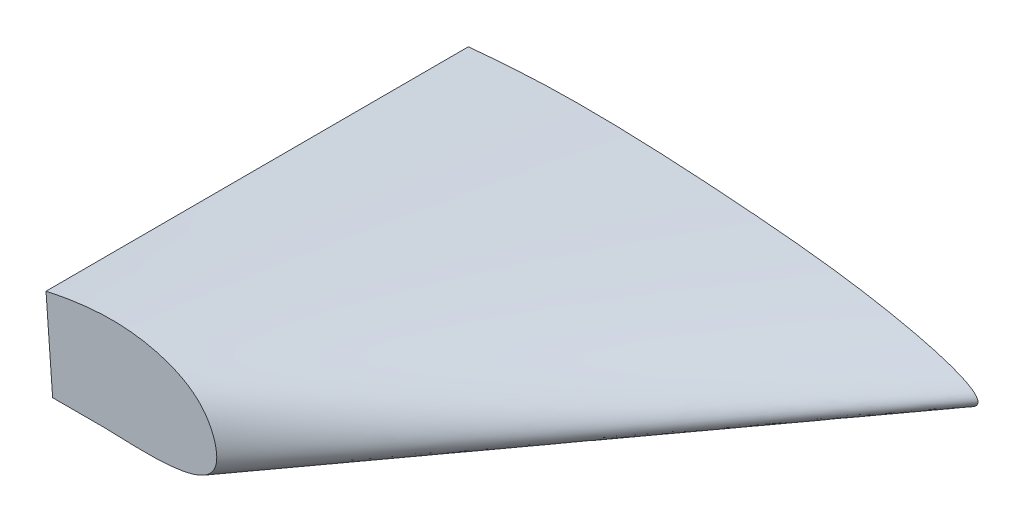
ISO-10303-21;
HEADER;
FILE_DESCRIPTION(('STEP AP214'),'2;1');
FILE_NAME('part.step','',(''),(''),'','','');
FILE_SCHEMA(('AUTOMOTIVE_DESIGN { 1 0 10303 214 1 1 1 1 }'));
ENDSEC;
DATA;
#1=APPLICATION_CONTEXT('core data for automotive mechanical design processes');
#2=APPLICATION_PROTOCOL_DEFINITION('international standard','automotive_design',2000,#1);
#3=PRODUCT_CONTEXT('',#1,'mechanical');
#4=PRODUCT('Part','Part','',(#3));
#5=PRODUCT_RELATED_PRODUCT_CATEGORY('part','',(#4));
#6=PRODUCT_DEFINITION_FORMATION('','',#4);
#7=PRODUCT_DEFINITION_CONTEXT('part definition',#1,'design');
#8=PRODUCT_DEFINITION('design','',#6,#7);
#9=PRODUCT_DEFINITION_SHAPE('','',#8);
#10=(LENGTH_UNIT() NAMED_UNIT(*) SI_UNIT(.MILLI.,.METRE.));
#11=(NAMED_UNIT(*) PLANE_ANGLE_UNIT() SI_UNIT($,.RADIAN.));
#12=(NAMED_UNIT(*) SI_UNIT($,.STERADIAN.) SOLID_ANGLE_UNIT());
#13=UNCERTAINTY_MEASURE_WITH_UNIT(LENGTH_MEASURE(1.E-05),#10,'distance_accuracy_value','');
#14=(GEOMETRIC_REPRESENTATION_CONTEXT(3) GLOBAL_UNCERTAINTY_ASSIGNED_CONTEXT((#13)) GLOBAL_UNIT_ASSIGNED_CONTEXT((#10,
#11,#12)) REPRESENTATION_CONTEXT('',''));
#15=CARTESIAN_POINT('',(0.,0.,0.));
#16=DIRECTION('',(0.,0.,1.));
#17=DIRECTION('',(1.,0.,0.));
#18=AXIS2_PLACEMENT_3D('',#15,#16,#17);
#19=CARTESIAN_POINT('',(2358.12019505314,78.0006455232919,1168.4));
#20=DIRECTION('',(0.,0.,1.));
#21=DIRECTION('',(-1.,0.,0.));
#22=AXIS2_PLACEMENT_3D('',#19,#20,#21);
#23=PLANE('',#22);
#24=CARTESIAN_POINT('',(991.0795134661,3.02535774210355E-12,1168.4));
#25=CARTESIAN_POINT('',(1318.15244994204,7.76386364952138,1168.4));
#26=CARTESIAN_POINT('',(1732.56684078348,17.6009870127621,1168.4));
#27=CARTESIAN_POINT('',(2432.72865642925,66.0722302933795,1168.4));
#28=CARTESIAN_POINT('',(2378.33186003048,146.158311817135,1168.4));
#29=CARTESIAN_POINT('',(2010.33013462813,220.773706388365,1168.4));
#30=CARTESIAN_POINT('',(1331.78741244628,279.195266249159,1168.4));
#31=CARTESIAN_POINT('',(1133.10522400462,261.588787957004,1168.4));
#32=CARTESIAN_POINT('',(972.611845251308,247.366460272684,1168.4));
#33=B_SPLINE_CURVE_WITH_KNOTS('',3,(#24,#25,#26,#27,#28,#29,#30,#31,#32),.UNSPECIFIED.,.F.,.F.,
(4,1,1,1,1,1,4),(0.,0.389152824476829,0.493072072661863,0.615836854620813,0.672676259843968,
0.735591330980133,1.),.UNSPECIFIED.);
#34=CARTESIAN_POINT('',(991.0795134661,0.,1168.4));
#35=VERTEX_POINT('',#34);
#36=CARTESIAN_POINT('',(1870.78429577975,30.3405175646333,1168.4));
#37=VERTEX_POINT('',#36);
#38=EDGE_CURVE('E42',#35,#37,#33,.T.);
#39=ORIENTED_EDGE('',*,*,#38,.F.);
#40=DIRECTION('',(-0.0744499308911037,0.997224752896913,0.));
#41=VECTOR('',#40,1.);
#42=CARTESIAN_POINT('',(991.0795134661,0.,1168.4));
#43=LINE('',#42,#41);
#44=CARTESIAN_POINT('',(972.611845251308,247.366460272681,1168.4));
#45=VERTEX_POINT('',#44);
#46=EDGE_CURVE('E84',#35,#45,#43,.T.);
#47=ORIENTED_EDGE('',*,*,#46,.T.);
#48=EDGE_CURVE('E81',#37,#45,#33,.T.);
#49=ORIENTED_EDGE('',*,*,#48,.F.);
#50=EDGE_LOOP('',(#39,#47,#49));
#51=FACE_BOUND('',#50,.T.);
#52=ADVANCED_FACE('F39',(#51),#23,.F.);
#53=CARTESIAN_POINT('',(1397.72688611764,190.837752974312,2336.8));
#54=DIRECTION('',(0.,0.,1.));
#55=DIRECTION('',(-1.,0.,0.));
#56=AXIS2_PLACEMENT_3D('',#53,#54,#55);
#57=PLANE('',#56);
#58=CARTESIAN_POINT('',(1134.39192219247,2.77614833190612E-12,2336.8));
#59=CARTESIAN_POINT('',(1288.06456339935,-5.80362582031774,2336.8));
#60=CARTESIAN_POINT('',(1484.66825155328,-13.228592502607,2336.8));
#61=CARTESIAN_POINT('',(1416.30744507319,198.082533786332,2336.8));
#62=CARTESIAN_POINT('',(1235.69366697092,286.287700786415,2336.8));
#63=CARTESIAN_POINT('',(1078.36500617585,268.9366943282,2336.8));
#64=CARTESIAN_POINT('',(972.709109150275,246.063652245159,2336.8));
#65=B_SPLINE_CURVE_WITH_KNOTS('',3,(#58,#59,#60,#61,#62,#63,#64),.UNSPECIFIED.,.F.,.F.,(4,1,1,1,
4),(0.,0.319584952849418,0.40886640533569,0.565476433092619,0.879497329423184),.UNSPECIFIED.);
#66=CARTESIAN_POINT('',(1134.39192219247,2.77614833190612E-12,2336.8));
#67=VERTEX_POINT('',#66);
#68=CARTESIAN_POINT('',(972.709109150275,246.063652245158,2336.8));
#69=VERTEX_POINT('',#68);
#70=EDGE_CURVE('E80',#67,#69,#65,.T.);
#71=ORIENTED_EDGE('',*,*,#70,.T.);
#72=DIRECTION('',(0.0744499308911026,-0.997224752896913,0.));
#73=VECTOR('',#72,1.);
#74=CARTESIAN_POINT('',(972.709109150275,246.063652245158,2336.8));
#75=LINE('',#74,#73);
#76=CARTESIAN_POINT('',(991.079513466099,2.88717063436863E-12,2336.8));
#77=VERTEX_POINT('',#76);
#78=EDGE_CURVE('E50',#69,#77,#75,.T.);
#79=ORIENTED_EDGE('',*,*,#78,.T.);
#80=DIRECTION('',(1.,0.,0.));
#81=VECTOR('',#80,1.);
#82=CARTESIAN_POINT('',(991.079513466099,2.88717063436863E-12,2336.8));
#83=LINE('',#82,#81);
#84=EDGE_CURVE('E11',#77,#67,#83,.T.);
#85=ORIENTED_EDGE('',*,*,#84,.T.);
#86=EDGE_LOOP('',(#71,#79,#85));
#87=FACE_BOUND('',#86,.T.);
#88=ADVANCED_FACE('F90',(#87),#57,.T.);
#89=CARTESIAN_POINT('',(991.079513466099,2.88717063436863E-12,2336.8));
#90=CARTESIAN_POINT('',(991.0795134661,3.02535774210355E-12,1168.4));
#91=CARTESIAN_POINT('',(1038.85031637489,2.85016320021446E-12,2336.8));
#92=CARTESIAN_POINT('',(1266.24263141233,6.53165912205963,1168.4));
#93=CARTESIAN_POINT('',(1086.62111928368,2.81315576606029E-12,2336.8));
#94=CARTESIAN_POINT('',(1541.40574935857,13.0633182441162,1168.4));
#95=CARTESIAN_POINT('',(1134.39192219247,2.77614833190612E-12,2336.8));
#96=CARTESIAN_POINT('',(1870.78429577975,30.3405175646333,1168.4));
#97=B_SPLINE_SURFACE_WITH_KNOTS('',3,1,((#89,#90),(#91,#92),(#93,#94),(#95,#96)),.UNSPECIFIED.,
.F.,.F.,.F.,(4,4),(2,2),(0.,1.),(0.,1.),.UNSPECIFIED.);
#98=DIRECTION('',(0.,0.,1.));
#99=VECTOR('',#98,1.);
#100=CARTESIAN_POINT('',(991.079513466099,2.95626418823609E-12,1752.6));
#101=LINE('',#100,#99);
#102=EDGE_CURVE('E83',#35,#77,#101,.T.);
#103=DIRECTION('',(0.533064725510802,0.021963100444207,-0.845789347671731));
#104=VECTOR('',#103,1.);
#105=CARTESIAN_POINT('',(1502.58810898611,15.170258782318,1752.6));
#106=LINE('',#105,#104);
#107=EDGE_CURVE('E59',#67,#37,#106,.T.);
#108=ORIENTED_EDGE('',*,*,#84,.F.);
#109=ORIENTED_EDGE('',*,*,#102,.F.);
#110=ORIENTED_EDGE('',*,*,#38,.T.);
#111=ORIENTED_EDGE('',*,*,#107,.F.);
#112=EDGE_LOOP('',(#108,#109,#110,#111));
#113=FACE_BOUND('',#112,.T.);
#114=ADVANCED_FACE('F101',(#113),#97,.F.);
#115=CARTESIAN_POINT('',(1134.39192219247,2.77614833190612E-12,2336.8));
#116=CARTESIAN_POINT('',(1870.78429577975,30.3405175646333,1168.4));
#117=CARTESIAN_POINT('',(1173.22543828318,-1.4665928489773,2336.8));
#118=CARTESIAN_POINT('',(1932.92191327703,33.5998798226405,1168.4));
#119=CARTESIAN_POINT('',(1277.39872764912,-5.40081814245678,2336.8));
#120=CARTESIAN_POINT('',(2104.78584704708,43.3691988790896,1168.4));
#121=CARTESIAN_POINT('',(1405.32173666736,5.56340944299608,2336.8));
#122=CARTESIAN_POINT('',(2382.65969502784,62.6060246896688,1168.4));
#123=CARTESIAN_POINT('',(1453.34288261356,61.722885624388,2336.8));
#124=CARTESIAN_POINT('',(2397.68635595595,117.663513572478,1168.4));
#125=CARTESIAN_POINT('',(1439.07196982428,127.714765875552,2336.8));
#126=CARTESIAN_POINT('',(2284.06742446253,160.811567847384,1168.4));
#127=CARTESIAN_POINT('',(1416.89536597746,170.329608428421,2336.8));
#128=CARTESIAN_POINT('',(2155.26409127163,191.387147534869,1168.4));
#129=CARTESIAN_POINT('',(1381.02328412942,210.687879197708,2336.8));
#130=CARTESIAN_POINT('',(1967.51427670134,224.460090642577,1168.4));
#131=CARTESIAN_POINT('',(1333.33752702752,236.338250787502,2336.8));
#132=CARTESIAN_POINT('',(1755.96591308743,242.674102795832,1168.4));
#133=CARTESIAN_POINT('',(1193.94281857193,281.683204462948,2336.8));
#134=CARTESIAN_POINT('',(1278.87536856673,274.506397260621,1168.4));
#135=CARTESIAN_POINT('',(1078.36500617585,268.9366943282,2336.8));
#136=CARTESIAN_POINT('',(1118.38198981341,260.284069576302,1168.4));
#137=CARTESIAN_POINT('',(972.709109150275,246.063652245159,2336.8));
#138=CARTESIAN_POINT('',(972.611845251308,247.366460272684,1168.4));
#139=B_SPLINE_SURFACE_WITH_KNOTS('',3,1,((#115,#116),(#117,#118),(#119,#120),(#121,#122),(#123,
#124),(#125,#126),(#127,#128),(#129,#130),(#131,#132),(#133,#134),(#135,#136),(#137,#138)),
.UNSPECIFIED.,.F.,.F.,.F.,(4,1,1,1,1,1,1,1,1,4),(2,2),(0.,0.0918252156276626,0.246326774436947,
0.363372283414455,0.428846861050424,0.464886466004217,0.513352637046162,0.606891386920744,
0.642954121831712,1.),(0.,1.),.UNSPECIFIED.);
#140=DIRECTION('',(-8.32453253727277E-05,0.00111503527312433,-0.999999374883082));
#141=VECTOR('',#140,1.);
#142=CARTESIAN_POINT('',(972.660477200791,246.715056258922,1752.6));
#143=LINE('',#142,#141);
#144=EDGE_CURVE('E73',#69,#45,#143,.T.);
#145=ORIENTED_EDGE('',*,*,#70,.F.);
#146=ORIENTED_EDGE('',*,*,#107,.T.);
#147=ORIENTED_EDGE('',*,*,#48,.T.);
#148=ORIENTED_EDGE('',*,*,#144,.F.);
#149=EDGE_LOOP('',(#145,#146,#147,#148));
#150=FACE_BOUND('',#149,.T.);
#151=ADVANCED_FACE('F78',(#150),#139,.F.);
#152=CARTESIAN_POINT('',(991.079513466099,2.94209101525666E-12,2336.8));
#153=DIRECTION('',(0.997224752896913,0.0744499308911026,0.));
#154=DIRECTION('',(-0.0744499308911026,0.997224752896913,0.));
#155=AXIS2_PLACEMENT_3D('',#152,#153,#154);
#156=PLANE('',#155);
#157=ORIENTED_EDGE('',*,*,#102,.T.);
#158=ORIENTED_EDGE('',*,*,#78,.F.);
#159=ORIENTED_EDGE('',*,*,#144,.T.);
#160=ORIENTED_EDGE('',*,*,#46,.F.);
#161=EDGE_LOOP('',(#157,#158,#159,#160));
#162=FACE_BOUND('',#161,.T.);
#163=ADVANCED_FACE('F87',(#162),#156,.F.);
#164=CLOSED_SHELL('',(#52,#88,#114,#151,#163));
#165=MANIFOLD_SOLID_BREP('B2',#164);
#166=ADVANCED_BREP_SHAPE_REPRESENTATION('',(#18,#165),#14);
#167=SHAPE_DEFINITION_REPRESENTATION(#9,#166);
ENDSEC;
END-ISO-10303-21;
